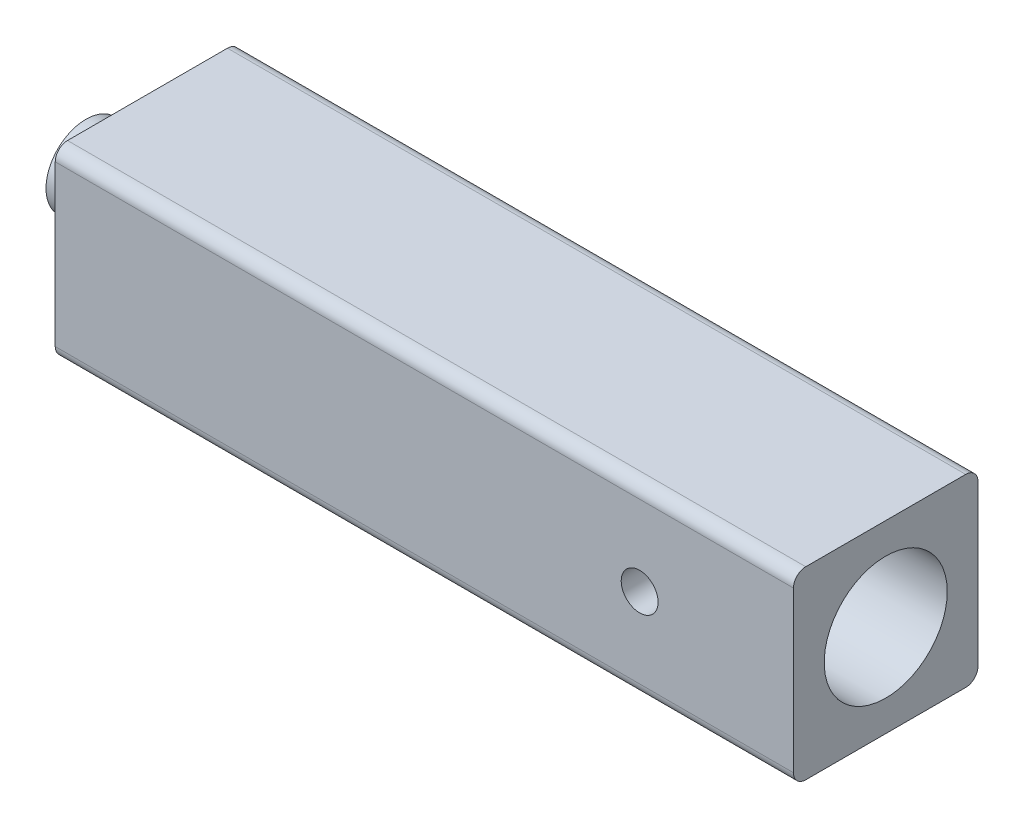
ISO-10303-21;
HEADER;
FILE_DESCRIPTION(('STEP AP214'),'2;1');
FILE_NAME('part.step','',(''),(''),'','','');
FILE_SCHEMA(('AUTOMOTIVE_DESIGN { 1 0 10303 214 1 1 1 1 }'));
ENDSEC;
DATA;
#1=APPLICATION_CONTEXT('core data for automotive mechanical design processes');
#2=APPLICATION_PROTOCOL_DEFINITION('international standard','automotive_design',2000,#1);
#3=PRODUCT_CONTEXT('',#1,'mechanical');
#4=PRODUCT('Part','Part','',(#3));
#5=PRODUCT_RELATED_PRODUCT_CATEGORY('part','',(#4));
#6=PRODUCT_DEFINITION_FORMATION('','',#4);
#7=PRODUCT_DEFINITION_CONTEXT('part definition',#1,'design');
#8=PRODUCT_DEFINITION('design','',#6,#7);
#9=PRODUCT_DEFINITION_SHAPE('','',#8);
#10=(LENGTH_UNIT() NAMED_UNIT(*) SI_UNIT(.MILLI.,.METRE.));
#11=(NAMED_UNIT(*) PLANE_ANGLE_UNIT() SI_UNIT($,.RADIAN.));
#12=(NAMED_UNIT(*) SI_UNIT($,.STERADIAN.) SOLID_ANGLE_UNIT());
#13=UNCERTAINTY_MEASURE_WITH_UNIT(LENGTH_MEASURE(1.E-05),#10,'distance_accuracy_value','');
#14=(GEOMETRIC_REPRESENTATION_CONTEXT(3) GLOBAL_UNCERTAINTY_ASSIGNED_CONTEXT((#13)) GLOBAL_UNIT_ASSIGNED_CONTEXT((#10,
#11,#12)) REPRESENTATION_CONTEXT('',''));
#15=CARTESIAN_POINT('',(0.,0.,0.));
#16=DIRECTION('',(0.,0.,1.));
#17=DIRECTION('',(1.,0.,0.));
#18=AXIS2_PLACEMENT_3D('',#15,#16,#17);
#19=CARTESIAN_POINT('',(120.,-15.,15.));
#20=DIRECTION('',(0.,0.,-1.));
#21=DIRECTION('',(-1.,0.,0.));
#22=AXIS2_PLACEMENT_3D('',#19,#20,#21);
#23=PLANE('',#22);
#24=CARTESIAN_POINT('',(95.,0.,15.));
#25=DIRECTION('',(0.,0.,-1.));
#26=DIRECTION('',(-1.,0.,0.));
#27=AXIS2_PLACEMENT_3D('',#24,#25,#26);
#28=CIRCLE('',#27,3.00000000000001);
#29=CARTESIAN_POINT('',(92.,0.,15.));
#30=VERTEX_POINT('',#29);
#31=EDGE_CURVE('E256',#30,#30,#28,.T.);
#32=ORIENTED_EDGE('',*,*,#31,.T.);
#33=EDGE_LOOP('',(#32));
#34=FACE_BOUND('',#33,.T.);
#35=DIRECTION('',(0.,-1.,0.));
#36=VECTOR('',#35,1.);
#37=CARTESIAN_POINT('',(0.,-15.,15.));
#38=LINE('',#37,#36);
#39=CARTESIAN_POINT('',(0.,13.,15.));
#40=VERTEX_POINT('',#39);
#41=CARTESIAN_POINT('',(0.,-13.,15.));
#42=VERTEX_POINT('',#41);
#43=EDGE_CURVE('E125',#40,#42,#38,.T.);
#44=ORIENTED_EDGE('',*,*,#43,.T.);
#45=DIRECTION('',(-1.,0.,0.));
#46=VECTOR('',#45,1.);
#47=CARTESIAN_POINT('',(120.,-13.,15.));
#48=LINE('',#47,#46);
#49=CARTESIAN_POINT('',(120.,-13.,15.));
#50=VERTEX_POINT('',#49);
#51=EDGE_CURVE('E103',#42,#50,#48,.F.);
#52=ORIENTED_EDGE('',*,*,#51,.T.);
#53=DIRECTION('',(0.,-1.,0.));
#54=VECTOR('',#53,1.);
#55=CARTESIAN_POINT('',(120.,-15.,15.));
#56=LINE('',#55,#54);
#57=CARTESIAN_POINT('',(120.,13.,15.));
#58=VERTEX_POINT('',#57);
#59=EDGE_CURVE('E135',#58,#50,#56,.T.);
#60=ORIENTED_EDGE('',*,*,#59,.F.);
#61=DIRECTION('',(-1.,0.,0.));
#62=VECTOR('',#61,1.);
#63=CARTESIAN_POINT('',(120.,13.,15.));
#64=LINE('',#63,#62);
#65=EDGE_CURVE('E108',#58,#40,#64,.T.);
#66=ORIENTED_EDGE('',*,*,#65,.T.);
#67=EDGE_LOOP('',(#44,#52,#60,#66));
#68=FACE_BOUND('',#67,.T.);
#69=ADVANCED_FACE('F32',(#34,#68),#23,.F.);
#70=CARTESIAN_POINT('',(120.,-15.,-15.));
#71=DIRECTION('',(0.,1.,0.));
#72=DIRECTION('',(0.,0.,1.));
#73=AXIS2_PLACEMENT_3D('',#70,#71,#72);
#74=PLANE('',#73);
#75=DIRECTION('',(0.,0.,-1.));
#76=VECTOR('',#75,1.);
#77=CARTESIAN_POINT('',(120.,-15.,-15.));
#78=LINE('',#77,#76);
#79=CARTESIAN_POINT('',(120.,-15.,13.));
#80=VERTEX_POINT('',#79);
#81=CARTESIAN_POINT('',(120.,-15.,-13.));
#82=VERTEX_POINT('',#81);
#83=EDGE_CURVE('E118',#80,#82,#78,.T.);
#84=ORIENTED_EDGE('',*,*,#83,.F.);
#85=DIRECTION('',(-1.,0.,0.));
#86=VECTOR('',#85,1.);
#87=CARTESIAN_POINT('',(120.,-15.,13.));
#88=LINE('',#87,#86);
#89=CARTESIAN_POINT('',(0.,-15.,13.));
#90=VERTEX_POINT('',#89);
#91=EDGE_CURVE('E102',#80,#90,#88,.T.);
#92=ORIENTED_EDGE('',*,*,#91,.T.);
#93=DIRECTION('',(0.,0.,-1.));
#94=VECTOR('',#93,1.);
#95=CARTESIAN_POINT('',(0.,-15.,-15.));
#96=LINE('',#95,#94);
#97=CARTESIAN_POINT('',(0.,-15.,-13.));
#98=VERTEX_POINT('',#97);
#99=EDGE_CURVE('E115',#90,#98,#96,.T.);
#100=ORIENTED_EDGE('',*,*,#99,.T.);
#101=DIRECTION('',(-1.,0.,0.));
#102=VECTOR('',#101,1.);
#103=CARTESIAN_POINT('',(120.,-15.,-13.));
#104=LINE('',#103,#102);
#105=EDGE_CURVE('E120',#98,#82,#104,.F.);
#106=ORIENTED_EDGE('',*,*,#105,.T.);
#107=EDGE_LOOP('',(#84,#92,#100,#106));
#108=FACE_BOUND('',#107,.T.);
#109=ADVANCED_FACE('F114',(#108),#74,.F.);
#110=CARTESIAN_POINT('',(120.,-15.,-15.));
#111=DIRECTION('',(0.,0.,1.));
#112=DIRECTION('',(1.,0.,0.));
#113=AXIS2_PLACEMENT_3D('',#110,#111,#112);
#114=PLANE('',#113);
#115=CARTESIAN_POINT('',(95.,0.,-15.));
#116=DIRECTION('',(0.,0.,1.));
#117=DIRECTION('',(1.,0.,0.));
#118=AXIS2_PLACEMENT_3D('',#115,#116,#117);
#119=CIRCLE('',#118,3.00000000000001);
#120=CARTESIAN_POINT('',(98.,0.,-15.));
#121=VERTEX_POINT('',#120);
#122=EDGE_CURVE('E254',#121,#121,#119,.T.);
#123=ORIENTED_EDGE('',*,*,#122,.T.);
#124=EDGE_LOOP('',(#123));
#125=FACE_BOUND('',#124,.T.);
#126=DIRECTION('',(0.,1.,0.));
#127=VECTOR('',#126,1.);
#128=CARTESIAN_POINT('',(120.,-15.,-15.));
#129=LINE('',#128,#127);
#130=CARTESIAN_POINT('',(120.,-13.,-15.));
#131=VERTEX_POINT('',#130);
#132=CARTESIAN_POINT('',(120.,13.,-15.));
#133=VERTEX_POINT('',#132);
#134=EDGE_CURVE('E212',#131,#133,#129,.T.);
#135=ORIENTED_EDGE('',*,*,#134,.F.);
#136=DIRECTION('',(-1.,0.,0.));
#137=VECTOR('',#136,1.);
#138=CARTESIAN_POINT('',(120.,-13.,-15.));
#139=LINE('',#138,#137);
#140=CARTESIAN_POINT('',(0.,-13.,-15.));
#141=VERTEX_POINT('',#140);
#142=EDGE_CURVE('E207',#131,#141,#139,.T.);
#143=ORIENTED_EDGE('',*,*,#142,.T.);
#144=DIRECTION('',(0.,1.,0.));
#145=VECTOR('',#144,1.);
#146=CARTESIAN_POINT('',(0.,-15.,-15.));
#147=LINE('',#146,#145);
#148=CARTESIAN_POINT('',(0.,13.,-15.));
#149=VERTEX_POINT('',#148);
#150=EDGE_CURVE('E124',#141,#149,#147,.T.);
#151=ORIENTED_EDGE('',*,*,#150,.T.);
#152=DIRECTION('',(-1.,0.,0.));
#153=VECTOR('',#152,1.);
#154=CARTESIAN_POINT('',(120.,13.,-15.));
#155=LINE('',#154,#153);
#156=EDGE_CURVE('E196',#149,#133,#155,.F.);
#157=ORIENTED_EDGE('',*,*,#156,.T.);
#158=EDGE_LOOP('',(#135,#143,#151,#157));
#159=FACE_BOUND('',#158,.T.);
#160=ADVANCED_FACE('F175',(#125,#159),#114,.F.);
#161=CARTESIAN_POINT('',(120.,15.,-15.));
#162=DIRECTION('',(0.,-1.,0.));
#163=DIRECTION('',(0.,0.,-1.));
#164=AXIS2_PLACEMENT_3D('',#161,#162,#163);
#165=PLANE('',#164);
#166=DIRECTION('',(0.,0.,1.));
#167=VECTOR('',#166,1.);
#168=CARTESIAN_POINT('',(120.,15.,-15.));
#169=LINE('',#168,#167);
#170=CARTESIAN_POINT('',(120.,15.,-13.));
#171=VERTEX_POINT('',#170);
#172=CARTESIAN_POINT('',(120.,15.,13.));
#173=VERTEX_POINT('',#172);
#174=EDGE_CURVE('E232',#171,#173,#169,.T.);
#175=ORIENTED_EDGE('',*,*,#174,.F.);
#176=DIRECTION('',(-1.,0.,0.));
#177=VECTOR('',#176,1.);
#178=CARTESIAN_POINT('',(120.,15.,-13.));
#179=LINE('',#178,#177);
#180=CARTESIAN_POINT('',(0.,15.,-13.));
#181=VERTEX_POINT('',#180);
#182=EDGE_CURVE('E11',#171,#181,#179,.T.);
#183=ORIENTED_EDGE('',*,*,#182,.T.);
#184=DIRECTION('',(0.,0.,1.));
#185=VECTOR('',#184,1.);
#186=CARTESIAN_POINT('',(0.,15.,-15.));
#187=LINE('',#186,#185);
#188=CARTESIAN_POINT('',(0.,15.,13.));
#189=VERTEX_POINT('',#188);
#190=EDGE_CURVE('E128',#181,#189,#187,.T.);
#191=ORIENTED_EDGE('',*,*,#190,.T.);
#192=DIRECTION('',(-1.,0.,0.));
#193=VECTOR('',#192,1.);
#194=CARTESIAN_POINT('',(120.,15.,13.));
#195=LINE('',#194,#193);
#196=EDGE_CURVE('E40',#189,#173,#195,.F.);
#197=ORIENTED_EDGE('',*,*,#196,.T.);
#198=EDGE_LOOP('',(#175,#183,#191,#197));
#199=FACE_BOUND('',#198,.T.);
#200=ADVANCED_FACE('F244',(#199),#165,.F.);
#201=CARTESIAN_POINT('',(120.,0.,0.));
#202=DIRECTION('',(1.,0.,0.));
#203=DIRECTION('',(0.,0.,-1.));
#204=AXIS2_PLACEMENT_3D('',#201,#202,#203);
#205=PLANE('',#204);
#206=CARTESIAN_POINT('',(120.,0.,0.));
#207=DIRECTION('',(1.,0.,0.));
#208=DIRECTION('',(0.,0.,-1.));
#209=AXIS2_PLACEMENT_3D('',#206,#207,#208);
#210=CIRCLE('',#209,10.);
#211=CARTESIAN_POINT('',(120.,0.,-10.));
#212=VERTEX_POINT('',#211);
#213=EDGE_CURVE('E229',#212,#212,#210,.T.);
#214=ORIENTED_EDGE('',*,*,#213,.F.);
#215=EDGE_LOOP('',(#214));
#216=FACE_BOUND('',#215,.T.);
#217=ORIENTED_EDGE('',*,*,#59,.T.);
#218=CARTESIAN_POINT('',(120.,-13.,13.));
#219=DIRECTION('',(1.,0.,0.));
#220=DIRECTION('',(0.,0.,-1.));
#221=AXIS2_PLACEMENT_3D('',#218,#219,#220);
#222=CIRCLE('',#221,2.);
#223=EDGE_CURVE('E200',#50,#80,#222,.T.);
#224=ORIENTED_EDGE('',*,*,#223,.T.);
#225=ORIENTED_EDGE('',*,*,#83,.T.);
#226=CARTESIAN_POINT('',(120.,-13.,-13.));
#227=DIRECTION('',(1.,0.,0.));
#228=DIRECTION('',(0.,0.,-1.));
#229=AXIS2_PLACEMENT_3D('',#226,#227,#228);
#230=CIRCLE('',#229,2.);
#231=EDGE_CURVE('E197',#82,#131,#230,.T.);
#232=ORIENTED_EDGE('',*,*,#231,.T.);
#233=ORIENTED_EDGE('',*,*,#134,.T.);
#234=CARTESIAN_POINT('',(120.,13.,-13.));
#235=DIRECTION('',(1.,0.,0.));
#236=DIRECTION('',(0.,0.,-1.));
#237=AXIS2_PLACEMENT_3D('',#234,#235,#236);
#238=CIRCLE('',#237,2.);
#239=EDGE_CURVE('E53',#133,#171,#238,.T.);
#240=ORIENTED_EDGE('',*,*,#239,.T.);
#241=ORIENTED_EDGE('',*,*,#174,.T.);
#242=CARTESIAN_POINT('',(120.,13.,13.));
#243=DIRECTION('',(1.,0.,0.));
#244=DIRECTION('',(0.,0.,-1.));
#245=AXIS2_PLACEMENT_3D('',#242,#243,#244);
#246=CIRCLE('',#245,2.);
#247=EDGE_CURVE('E198',#173,#58,#246,.T.);
#248=ORIENTED_EDGE('',*,*,#247,.T.);
#249=EDGE_LOOP('',(#217,#224,#225,#232,#233,#240,#241,#248));
#250=FACE_BOUND('',#249,.T.);
#251=ADVANCED_FACE('F224',(#216,#250),#205,.T.);
#252=CARTESIAN_POINT('',(0.,0.,0.));
#253=DIRECTION('',(1.,0.,0.));
#254=DIRECTION('',(0.,0.,-1.));
#255=AXIS2_PLACEMENT_3D('',#252,#253,#254);
#256=PLANE('',#255);
#257=CARTESIAN_POINT('',(0.,0.,0.));
#258=DIRECTION('',(1.,0.,0.));
#259=DIRECTION('',(0.,0.,-1.));
#260=AXIS2_PLACEMENT_3D('',#257,#258,#259);
#261=CIRCLE('',#260,6.5);
#262=CARTESIAN_POINT('',(0.,0.,-6.5));
#263=VERTEX_POINT('',#262);
#264=EDGE_CURVE('E233',#263,#263,#261,.F.);
#265=ORIENTED_EDGE('',*,*,#264,.F.);
#266=EDGE_LOOP('',(#265));
#267=FACE_BOUND('',#266,.T.);
#268=ORIENTED_EDGE('',*,*,#99,.F.);
#269=CARTESIAN_POINT('',(0.,-13.,13.));
#270=DIRECTION('',(1.,0.,0.));
#271=DIRECTION('',(0.,0.,-1.));
#272=AXIS2_PLACEMENT_3D('',#269,#270,#271);
#273=CIRCLE('',#272,2.);
#274=EDGE_CURVE('E98',#90,#42,#273,.F.);
#275=ORIENTED_EDGE('',*,*,#274,.T.);
#276=ORIENTED_EDGE('',*,*,#43,.F.);
#277=CARTESIAN_POINT('',(0.,13.,13.));
#278=DIRECTION('',(1.,0.,0.));
#279=DIRECTION('',(0.,0.,-1.));
#280=AXIS2_PLACEMENT_3D('',#277,#278,#279);
#281=CIRCLE('',#280,2.);
#282=EDGE_CURVE('E119',#40,#189,#281,.F.);
#283=ORIENTED_EDGE('',*,*,#282,.T.);
#284=ORIENTED_EDGE('',*,*,#190,.F.);
#285=CARTESIAN_POINT('',(0.,13.,-13.));
#286=DIRECTION('',(1.,0.,0.));
#287=DIRECTION('',(0.,0.,-1.));
#288=AXIS2_PLACEMENT_3D('',#285,#286,#287);
#289=CIRCLE('',#288,2.);
#290=EDGE_CURVE('E215',#181,#149,#289,.F.);
#291=ORIENTED_EDGE('',*,*,#290,.T.);
#292=ORIENTED_EDGE('',*,*,#150,.F.);
#293=CARTESIAN_POINT('',(0.,-13.,-13.));
#294=DIRECTION('',(1.,0.,0.));
#295=DIRECTION('',(0.,0.,-1.));
#296=AXIS2_PLACEMENT_3D('',#293,#294,#295);
#297=CIRCLE('',#296,2.);
#298=EDGE_CURVE('E109',#141,#98,#297,.F.);
#299=ORIENTED_EDGE('',*,*,#298,.T.);
#300=EDGE_LOOP('',(#268,#275,#276,#283,#284,#291,#292,#299));
#301=FACE_BOUND('',#300,.T.);
#302=ADVANCED_FACE('F122',(#267,#301),#256,.F.);
#303=CARTESIAN_POINT('',(80.,0.,0.));
#304=DIRECTION('',(1.,0.,0.));
#305=DIRECTION('',(0.,0.,-1.));
#306=AXIS2_PLACEMENT_3D('',#303,#304,#305);
#307=CYLINDRICAL_SURFACE('',#306,10.);
#308=CARTESIAN_POINT('',(92.,0.,-10.));
#309=CARTESIAN_POINT('',(92.0000019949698,0.164577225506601,-9.999998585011));
#310=CARTESIAN_POINT('',(92.0135877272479,0.329174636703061,-9.99589831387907));
#311=CARTESIAN_POINT('',(92.0674427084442,0.653576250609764,-9.97994211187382));
#312=CARTESIAN_POINT('',(92.1077199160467,0.813379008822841,-9.96808386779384));
#313=CARTESIAN_POINT('',(92.2134920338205,1.12346541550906,-9.93791105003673));
#314=CARTESIAN_POINT('',(92.2789497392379,1.27376272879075,-9.91960600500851));
#315=CARTESIAN_POINT('',(92.4330721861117,1.56124836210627,-9.8784421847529));
#316=CARTESIAN_POINT('',(92.5217400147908,1.69843493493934,-9.85558280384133));
#317=CARTESIAN_POINT('',(92.7224480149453,1.95974359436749,-9.80701474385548));
#318=CARTESIAN_POINT('',(92.8350332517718,2.08343614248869,-9.78124767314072));
#319=CARTESIAN_POINT('',(93.0792184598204,2.31049841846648,-9.73011668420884));
#320=CARTESIAN_POINT('',(93.2108216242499,2.41386472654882,-9.70475283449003));
#321=CARTESIAN_POINT('',(93.4929415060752,2.59960075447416,-9.65668227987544));
#322=CARTESIAN_POINT('',(93.6438169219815,2.68144618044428,-9.63404813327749));
#323=CARTESIAN_POINT('',(93.9579785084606,2.81842789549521,-9.59487240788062));
#324=CARTESIAN_POINT('',(94.1212616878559,2.87357059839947,-9.57832936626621));
#325=CARTESIAN_POINT('',(94.4507805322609,2.95403267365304,-9.55381741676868));
#326=CARTESIAN_POINT('',(94.6168054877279,2.98014392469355,-9.54562138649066));
#327=CARTESIAN_POINT('',(94.9510663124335,3.00427461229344,-9.53805579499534));
#328=CARTESIAN_POINT('',(95.1193016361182,3.00230085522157,-9.53868409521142));
#329=CARTESIAN_POINT('',(95.446767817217,2.97093954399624,-9.54849488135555));
#330=CARTESIAN_POINT('',(95.6061045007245,2.94254410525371,-9.55736777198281));
#331=CARTESIAN_POINT('',(95.9176395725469,2.86074840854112,-9.58216712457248));
#332=CARTESIAN_POINT('',(96.0698372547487,2.80734568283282,-9.59809428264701));
#333=CARTESIAN_POINT('',(96.3652006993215,2.67632053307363,-9.63545466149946));
#334=CARTESIAN_POINT('',(96.5082141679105,2.59837633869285,-9.65696032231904));
#335=CARTESIAN_POINT('',(96.7794640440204,2.42070445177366,-9.70301974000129));
#336=CARTESIAN_POINT('',(96.9076968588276,2.32097148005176,-9.72757423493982));
#337=CARTESIAN_POINT('',(97.1513723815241,2.09762581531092,-9.77822022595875));
#338=CARTESIAN_POINT('',(97.2660573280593,1.97318981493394,-9.80433308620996));
#339=CARTESIAN_POINT('',(97.4731079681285,1.70652651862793,-9.85424488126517));
#340=CARTESIAN_POINT('',(97.5654722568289,1.56429810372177,-9.8780436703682));
#341=CARTESIAN_POINT('',(97.7257198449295,1.2647100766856,-9.92086320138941));
#342=CARTESIAN_POINT('',(97.7934350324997,1.10725549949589,-9.93985087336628));
#343=CARTESIAN_POINT('',(97.9011991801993,0.782490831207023,-9.97067043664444));
#344=CARTESIAN_POINT('',(97.941255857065,0.615183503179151,-9.98250432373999));
#345=CARTESIAN_POINT('',(97.9913043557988,0.281904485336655,-9.99736729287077));
#346=CARTESIAN_POINT('',(98.0023231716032,0.116100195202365,-10.0006970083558));
#347=CARTESIAN_POINT('',(97.9968616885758,-0.214999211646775,-9.99905846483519));
#348=CARTESIAN_POINT('',(97.9803850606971,-0.38029439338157,-9.99409131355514));
#349=CARTESIAN_POINT('',(97.921230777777,-0.701807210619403,-9.97661393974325));
#350=CARTESIAN_POINT('',(97.8791532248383,-0.858145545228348,-9.96427659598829));
#351=CARTESIAN_POINT('',(97.7707135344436,-1.16150927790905,-9.9334869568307));
#352=CARTESIAN_POINT('',(97.7043484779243,-1.30853355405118,-9.91503392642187));
#353=CARTESIAN_POINT('',(97.5474936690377,-1.59287437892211,-9.87339308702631));
#354=CARTESIAN_POINT('',(97.456481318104,-1.72988765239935,-9.8501056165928));
#355=CARTESIAN_POINT('',(97.2535504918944,-1.98704661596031,-9.80146937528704));
#356=CARTESIAN_POINT('',(97.1416267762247,-2.1071880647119,-9.77612008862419));
#357=CARTESIAN_POINT('',(96.8952253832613,-2.33171489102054,-9.72506343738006));
#358=CARTESIAN_POINT('',(96.7600762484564,-2.43536962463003,-9.69937650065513));
#359=CARTESIAN_POINT('',(96.4737441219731,-2.61857990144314,-9.65153030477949));
#360=CARTESIAN_POINT('',(96.3225615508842,-2.69813607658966,-9.62937095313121));
#361=CARTESIAN_POINT('',(96.00893501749,-2.83034694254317,-9.59134379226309));
#362=CARTESIAN_POINT('',(95.8465476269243,-2.88312693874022,-9.575446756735));
#363=CARTESIAN_POINT('',(95.5146240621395,-2.96043461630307,-9.55183188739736));
#364=CARTESIAN_POINT('',(95.3450903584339,-2.9849719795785,-9.54411125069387));
#365=CARTESIAN_POINT('',(95.0112769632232,-3.00443968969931,-9.53799944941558));
#366=CARTESIAN_POINT('',(94.8470726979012,-3.00056110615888,-9.53923294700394));
#367=CARTESIAN_POINT('',(94.5217717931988,-2.96615010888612,-9.54998802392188));
#368=CARTESIAN_POINT('',(94.360675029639,-2.93561876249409,-9.55950927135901));
#369=CARTESIAN_POINT('',(94.0481092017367,-2.84953777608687,-9.58551527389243));
#370=CARTESIAN_POINT('',(93.8965454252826,-2.79430351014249,-9.60191209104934));
#371=CARTESIAN_POINT('',(93.6047151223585,-2.66063014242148,-9.63980557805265));
#372=CARTESIAN_POINT('',(93.4644507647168,-2.58218659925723,-9.6613032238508));
#373=CARTESIAN_POINT('',(93.1936737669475,-2.40097527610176,-9.70795352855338));
#374=CARTESIAN_POINT('',(93.0637024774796,-2.29742552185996,-9.7332108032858));
#375=CARTESIAN_POINT('',(92.8225950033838,-2.07034869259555,-9.78402640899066));
#376=CARTESIAN_POINT('',(92.7114637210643,-1.94681643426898,-9.80958481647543));
#377=CARTESIAN_POINT('',(92.5079531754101,-1.67893152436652,-9.85901873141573));
#378=CARTESIAN_POINT('',(92.416217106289,-1.53407577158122,-9.88282319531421));
#379=CARTESIAN_POINT('',(92.2585296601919,-1.23028274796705,-9.92521360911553));
#380=CARTESIAN_POINT('',(92.192566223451,-1.07135210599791,-9.94380199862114));
#381=CARTESIAN_POINT('',(92.0942094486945,-0.76151542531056,-9.97204349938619));
#382=CARTESIAN_POINT('',(92.0589766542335,-0.611573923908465,-9.9824405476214));
#383=CARTESIAN_POINT('',(92.0118729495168,-0.307760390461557,-9.9964188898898));
#384=CARTESIAN_POINT('',(91.9999981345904,-0.153889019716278,-10.0000013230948));
#385=CARTESIAN_POINT('',(92.,0.,-10.));
#386=B_SPLINE_CURVE_WITH_KNOTS('',3,(#308,#309,#310,#311,#312,#313,#314,#315,#316,#317,#318,
#319,#320,#321,#322,#323,#324,#325,#326,#327,#328,#329,#330,#331,#332,#333,#334,#335,#336,#337,
#338,#339,#340,#341,#342,#343,#344,#345,#346,#347,#348,#349,#350,#351,#352,#353,#354,#355,#356,
#357,#358,#359,#360,#361,#362,#363,#364,#365,#366,#367,#368,#369,#370,#371,#372,#373,#374,#375,
#376,#377,#378,#379,#380,#381,#382,#383,#384,#385),.UNSPECIFIED.,.T.,.F.,(4,2,2,2,2,2,2,2,2,2,2,
2,2,2,2,2,2,2,2,2,2,2,2,2,2,2,2,2,2,2,2,2,2,2,2,2,2,2,4),(0.,0.493166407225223,
0.986479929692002,1.47906735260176,1.97172032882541,2.47711205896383,2.98258874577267,
3.4994296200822,4.01614629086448,4.51839378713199,5.02051956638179,5.50452033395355,
5.98856887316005,6.47924852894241,6.97004720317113,7.48134208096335,7.99266913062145,
8.50742093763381,9.02202907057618,9.51817618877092,10.0142570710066,10.4991349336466,
10.9840710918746,11.4802261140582,11.9765056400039,12.4908080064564,13.0050968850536,
13.5169562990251,14.0286401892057,14.5190031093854,15.0093463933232,15.4936008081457,
15.9779479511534,16.4799385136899,16.9820594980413,17.4988599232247,18.015418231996,
18.4766338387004,18.9377723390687),.UNSPECIFIED.);
#387=CARTESIAN_POINT('',(92.,0.,-10.));
#388=VERTEX_POINT('',#387);
#389=EDGE_CURVE('E143',#388,#388,#386,.T.);
#390=ORIENTED_EDGE('',*,*,#389,.T.);
#391=EDGE_LOOP('',(#390));
#392=FACE_BOUND('',#391,.T.);
#393=CARTESIAN_POINT('',(98.,0.,10.));
#394=CARTESIAN_POINT('',(97.9999980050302,0.164577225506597,9.99999858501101));
#395=CARTESIAN_POINT('',(97.9864122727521,0.329174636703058,9.99589831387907));
#396=CARTESIAN_POINT('',(97.9325572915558,0.653576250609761,9.97994211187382));
#397=CARTESIAN_POINT('',(97.8922800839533,0.813379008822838,9.96808386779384));
#398=CARTESIAN_POINT('',(97.7865079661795,1.12346541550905,9.93791105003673));
#399=CARTESIAN_POINT('',(97.7210502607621,1.27376272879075,9.91960600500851));
#400=CARTESIAN_POINT('',(97.5669278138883,1.56124836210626,9.87844218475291));
#401=CARTESIAN_POINT('',(97.4782599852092,1.69843493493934,9.85558280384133));
#402=CARTESIAN_POINT('',(97.2775519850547,1.95974359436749,9.80701474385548));
#403=CARTESIAN_POINT('',(97.1649667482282,2.08343614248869,9.78124767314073));
#404=CARTESIAN_POINT('',(96.9207815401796,2.31049841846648,9.73011668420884));
#405=CARTESIAN_POINT('',(96.7891783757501,2.41386472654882,9.70475283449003));
#406=CARTESIAN_POINT('',(96.5070584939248,2.59960075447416,9.65668227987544));
#407=CARTESIAN_POINT('',(96.3561830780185,2.68144618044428,9.63404813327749));
#408=CARTESIAN_POINT('',(96.0420214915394,2.81842789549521,9.59487240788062));
#409=CARTESIAN_POINT('',(95.8787383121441,2.87357059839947,9.57832936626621));
#410=CARTESIAN_POINT('',(95.5492194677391,2.95403267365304,9.55381741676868));
#411=CARTESIAN_POINT('',(95.3831945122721,2.98014392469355,9.54562138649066));
#412=CARTESIAN_POINT('',(95.0489336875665,3.00427461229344,9.53805579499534));
#413=CARTESIAN_POINT('',(94.8806983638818,3.00230085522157,9.53868409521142));
#414=CARTESIAN_POINT('',(94.553232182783,2.97093954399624,9.54849488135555));
#415=CARTESIAN_POINT('',(94.3938954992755,2.94254410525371,9.55736777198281));
#416=CARTESIAN_POINT('',(94.0823604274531,2.86074840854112,9.58216712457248));
#417=CARTESIAN_POINT('',(93.9301627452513,2.80734568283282,9.59809428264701));
#418=CARTESIAN_POINT('',(93.6347993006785,2.67632053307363,9.63545466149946));
#419=CARTESIAN_POINT('',(93.4917858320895,2.59837633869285,9.65696032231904));
#420=CARTESIAN_POINT('',(93.2205359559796,2.42070445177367,9.70301974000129));
#421=CARTESIAN_POINT('',(93.0923031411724,2.32097148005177,9.72757423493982));
#422=CARTESIAN_POINT('',(92.848627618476,2.09762581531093,9.77822022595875));
#423=CARTESIAN_POINT('',(92.7339426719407,1.97318981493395,9.80433308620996));
#424=CARTESIAN_POINT('',(92.5268920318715,1.70652651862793,9.85424488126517));
#425=CARTESIAN_POINT('',(92.4345277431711,1.56429810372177,9.8780436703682));
#426=CARTESIAN_POINT('',(92.2742801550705,1.2647100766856,9.92086320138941));
#427=CARTESIAN_POINT('',(92.2065649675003,1.1072554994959,9.93985087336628));
#428=CARTESIAN_POINT('',(92.0988008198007,0.782490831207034,9.97067043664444));
#429=CARTESIAN_POINT('',(92.058744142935,0.615183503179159,9.98250432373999));
#430=CARTESIAN_POINT('',(92.0086956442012,0.281904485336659,9.99736729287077));
#431=CARTESIAN_POINT('',(91.9976768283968,0.11610019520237,10.0006970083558));
#432=CARTESIAN_POINT('',(92.0031383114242,-0.21499921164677,9.99905846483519));
#433=CARTESIAN_POINT('',(92.0196149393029,-0.380294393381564,9.99409131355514));
#434=CARTESIAN_POINT('',(92.078769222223,-0.701807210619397,9.97661393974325));
#435=CARTESIAN_POINT('',(92.1208467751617,-0.858145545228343,9.96427659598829));
#436=CARTESIAN_POINT('',(92.2292864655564,-1.16150927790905,9.9334869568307));
#437=CARTESIAN_POINT('',(92.2956515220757,-1.30853355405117,9.91503392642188));
#438=CARTESIAN_POINT('',(92.4525063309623,-1.59287437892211,9.87339308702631));
#439=CARTESIAN_POINT('',(92.543518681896,-1.72988765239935,9.8501056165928));
#440=CARTESIAN_POINT('',(92.7464495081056,-1.98704661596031,9.80146937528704));
#441=CARTESIAN_POINT('',(92.8583732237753,-2.10718806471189,9.77612008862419));
#442=CARTESIAN_POINT('',(93.1047746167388,-2.33171489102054,9.72506343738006));
#443=CARTESIAN_POINT('',(93.2399237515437,-2.43536962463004,9.69937650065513));
#444=CARTESIAN_POINT('',(93.5262558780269,-2.61857990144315,9.65153030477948));
#445=CARTESIAN_POINT('',(93.6774384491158,-2.69813607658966,9.62937095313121));
#446=CARTESIAN_POINT('',(93.99106498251,-2.83034694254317,9.59134379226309));
#447=CARTESIAN_POINT('',(94.1534523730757,-2.88312693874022,9.575446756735));
#448=CARTESIAN_POINT('',(94.4853759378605,-2.96043461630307,9.55183188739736));
#449=CARTESIAN_POINT('',(94.6549096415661,-2.9849719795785,9.54411125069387));
#450=CARTESIAN_POINT('',(94.9887230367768,-3.00443968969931,9.53799944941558));
#451=CARTESIAN_POINT('',(95.1529273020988,-3.00056110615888,9.53923294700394));
#452=CARTESIAN_POINT('',(95.4782282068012,-2.96615010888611,9.54998802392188));
#453=CARTESIAN_POINT('',(95.639324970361,-2.93561876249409,9.55950927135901));
#454=CARTESIAN_POINT('',(95.9518907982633,-2.84953777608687,9.58551527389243));
#455=CARTESIAN_POINT('',(96.1034545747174,-2.79430351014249,9.60191209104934));
#456=CARTESIAN_POINT('',(96.3952848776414,-2.66063014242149,9.63980557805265));
#457=CARTESIAN_POINT('',(96.5355492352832,-2.58218659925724,9.6613032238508));
#458=CARTESIAN_POINT('',(96.8063262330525,-2.40097527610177,9.70795352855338));
#459=CARTESIAN_POINT('',(96.9362975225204,-2.29742552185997,9.7332108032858));
#460=CARTESIAN_POINT('',(97.1774049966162,-2.07034869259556,9.78402640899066));
#461=CARTESIAN_POINT('',(97.2885362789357,-1.94681643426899,9.80958481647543));
#462=CARTESIAN_POINT('',(97.4920468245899,-1.67893152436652,9.85901873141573));
#463=CARTESIAN_POINT('',(97.583782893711,-1.53407577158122,9.88282319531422));
#464=CARTESIAN_POINT('',(97.7414703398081,-1.23028274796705,9.92521360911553));
#465=CARTESIAN_POINT('',(97.807433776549,-1.07135210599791,9.94380199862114));
#466=CARTESIAN_POINT('',(97.9057905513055,-0.761515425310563,9.97204349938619));
#467=CARTESIAN_POINT('',(97.9410233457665,-0.611573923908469,9.9824405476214));
#468=CARTESIAN_POINT('',(97.9881270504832,-0.307760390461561,9.9964188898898));
#469=CARTESIAN_POINT('',(98.0000018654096,-0.153889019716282,10.0000013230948));
#470=CARTESIAN_POINT('',(98.,0.,10.));
#471=B_SPLINE_CURVE_WITH_KNOTS('',3,(#393,#394,#395,#396,#397,#398,#399,#400,#401,#402,#403,
#404,#405,#406,#407,#408,#409,#410,#411,#412,#413,#414,#415,#416,#417,#418,#419,#420,#421,#422,
#423,#424,#425,#426,#427,#428,#429,#430,#431,#432,#433,#434,#435,#436,#437,#438,#439,#440,#441,
#442,#443,#444,#445,#446,#447,#448,#449,#450,#451,#452,#453,#454,#455,#456,#457,#458,#459,#460,
#461,#462,#463,#464,#465,#466,#467,#468,#469,#470),.UNSPECIFIED.,.T.,.F.,(4,2,2,2,2,2,2,2,2,2,2,
2,2,2,2,2,2,2,2,2,2,2,2,2,2,2,2,2,2,2,2,2,2,2,2,2,2,2,4),(0.,0.493166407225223,
0.986479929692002,1.47906735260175,1.97172032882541,2.47711205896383,2.98258874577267,
3.4994296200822,4.01614629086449,4.51839378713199,5.02051956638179,5.50452033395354,
5.98856887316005,6.47924852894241,6.97004720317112,7.48134208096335,7.99266913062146,
8.5074209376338,9.02202907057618,9.51817618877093,10.0142570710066,10.4991349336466,
10.9840710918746,11.4802261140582,11.9765056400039,12.4908080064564,13.0050968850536,
13.5169562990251,14.0286401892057,14.5190031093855,15.0093463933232,15.4936008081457,
15.9779479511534,16.4799385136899,16.9820594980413,17.4988599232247,18.015418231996,
18.4766338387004,18.9377723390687),.UNSPECIFIED.);
#472=CARTESIAN_POINT('',(98.,0.,10.));
#473=VERTEX_POINT('',#472);
#474=EDGE_CURVE('E136',#473,#473,#471,.T.);
#475=ORIENTED_EDGE('',*,*,#474,.T.);
#476=EDGE_LOOP('',(#475));
#477=FACE_BOUND('',#476,.T.);
#478=CARTESIAN_POINT('',(80.,0.,0.));
#479=DIRECTION('',(1.,0.,0.));
#480=DIRECTION('',(0.,0.,-1.));
#481=AXIS2_PLACEMENT_3D('',#478,#479,#480);
#482=CIRCLE('',#481,10.);
#483=CARTESIAN_POINT('',(80.,0.,-10.));
#484=VERTEX_POINT('',#483);
#485=EDGE_CURVE('E130',#484,#484,#482,.T.);
#486=ORIENTED_EDGE('',*,*,#485,.F.);
#487=EDGE_LOOP('',(#486));
#488=FACE_BOUND('',#487,.T.);
#489=ORIENTED_EDGE('',*,*,#213,.T.);
#490=EDGE_LOOP('',(#489));
#491=FACE_BOUND('',#490,.T.);
#492=ADVANCED_FACE('F148',(#392,#477,#488,#491),#307,.F.);
#493=CARTESIAN_POINT('',(80.,0.,0.));
#494=DIRECTION('',(1.,0.,0.));
#495=DIRECTION('',(0.,0.,-1.));
#496=AXIS2_PLACEMENT_3D('',#493,#494,#495);
#497=PLANE('',#496);
#498=ORIENTED_EDGE('',*,*,#485,.T.);
#499=EDGE_LOOP('',(#498));
#500=FACE_BOUND('',#499,.T.);
#501=ADVANCED_FACE('F157',(#500),#497,.T.);
#502=CARTESIAN_POINT('',(95.,0.,-20.));
#503=DIRECTION('',(0.,0.,1.));
#504=DIRECTION('',(1.,0.,0.));
#505=AXIS2_PLACEMENT_3D('',#502,#503,#504);
#506=CYLINDRICAL_SURFACE('',#505,3.00000000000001);
#507=ORIENTED_EDGE('',*,*,#474,.F.);
#508=EDGE_LOOP('',(#507));
#509=FACE_BOUND('',#508,.T.);
#510=ORIENTED_EDGE('',*,*,#31,.F.);
#511=EDGE_LOOP('',(#510));
#512=FACE_BOUND('',#511,.T.);
#513=ADVANCED_FACE('F152',(#509,#512),#506,.F.);
#514=ORIENTED_EDGE('',*,*,#389,.F.);
#515=EDGE_LOOP('',(#514));
#516=FACE_BOUND('',#515,.T.);
#517=ORIENTED_EDGE('',*,*,#122,.F.);
#518=EDGE_LOOP('',(#517));
#519=FACE_BOUND('',#518,.T.);
#520=ADVANCED_FACE('F156',(#516,#519),#506,.F.);
#521=CARTESIAN_POINT('',(-10.,0.,0.));
#522=DIRECTION('',(1.,0.,0.));
#523=DIRECTION('',(0.,0.,-1.));
#524=AXIS2_PLACEMENT_3D('',#521,#522,#523);
#525=CYLINDRICAL_SURFACE('',#524,6.5);
#526=CARTESIAN_POINT('',(-10.,0.,0.));
#527=DIRECTION('',(-1.,0.,0.));
#528=DIRECTION('',(0.,0.,1.));
#529=AXIS2_PLACEMENT_3D('',#526,#527,#528);
#530=CIRCLE('',#529,6.5);
#531=CARTESIAN_POINT('',(-10.,0.,6.5));
#532=VERTEX_POINT('',#531);
#533=EDGE_CURVE('E144',#532,#532,#530,.T.);
#534=ORIENTED_EDGE('',*,*,#533,.F.);
#535=EDGE_LOOP('',(#534));
#536=FACE_BOUND('',#535,.T.);
#537=ORIENTED_EDGE('',*,*,#264,.T.);
#538=EDGE_LOOP('',(#537));
#539=FACE_BOUND('',#538,.T.);
#540=ADVANCED_FACE('F159',(#536,#539),#525,.T.);
#541=CARTESIAN_POINT('',(-10.,0.,0.));
#542=DIRECTION('',(-1.,0.,0.));
#543=DIRECTION('',(0.,0.,1.));
#544=AXIS2_PLACEMENT_3D('',#541,#542,#543);
#545=PLANE('',#544);
#546=ORIENTED_EDGE('',*,*,#533,.T.);
#547=EDGE_LOOP('',(#546));
#548=FACE_BOUND('',#547,.T.);
#549=ADVANCED_FACE('F184',(#548),#545,.T.);
#550=CARTESIAN_POINT('',(120.,-13.,13.));
#551=DIRECTION('',(-1.,0.,0.));
#552=DIRECTION('',(0.,0.,1.));
#553=AXIS2_PLACEMENT_3D('',#550,#551,#552);
#554=CYLINDRICAL_SURFACE('',#553,2.);
#555=ORIENTED_EDGE('',*,*,#223,.F.);
#556=ORIENTED_EDGE('',*,*,#51,.F.);
#557=ORIENTED_EDGE('',*,*,#274,.F.);
#558=ORIENTED_EDGE('',*,*,#91,.F.);
#559=EDGE_LOOP('',(#555,#556,#557,#558));
#560=FACE_BOUND('',#559,.T.);
#561=ADVANCED_FACE('F101',(#560),#554,.T.);
#562=CARTESIAN_POINT('',(120.,-13.,-13.));
#563=DIRECTION('',(-1.,0.,0.));
#564=DIRECTION('',(0.,0.,1.));
#565=AXIS2_PLACEMENT_3D('',#562,#563,#564);
#566=CYLINDRICAL_SURFACE('',#565,2.);
#567=ORIENTED_EDGE('',*,*,#231,.F.);
#568=ORIENTED_EDGE('',*,*,#105,.F.);
#569=ORIENTED_EDGE('',*,*,#298,.F.);
#570=ORIENTED_EDGE('',*,*,#142,.F.);
#571=EDGE_LOOP('',(#567,#568,#569,#570));
#572=FACE_BOUND('',#571,.T.);
#573=ADVANCED_FACE('F183',(#572),#566,.T.);
#574=CARTESIAN_POINT('',(120.,13.,-13.));
#575=DIRECTION('',(-1.,0.,0.));
#576=DIRECTION('',(0.,0.,1.));
#577=AXIS2_PLACEMENT_3D('',#574,#575,#576);
#578=CYLINDRICAL_SURFACE('',#577,2.);
#579=ORIENTED_EDGE('',*,*,#239,.F.);
#580=ORIENTED_EDGE('',*,*,#156,.F.);
#581=ORIENTED_EDGE('',*,*,#290,.F.);
#582=ORIENTED_EDGE('',*,*,#182,.F.);
#583=EDGE_LOOP('',(#579,#580,#581,#582));
#584=FACE_BOUND('',#583,.T.);
#585=ADVANCED_FACE('F186',(#584),#578,.T.);
#586=CARTESIAN_POINT('',(120.,13.,13.));
#587=DIRECTION('',(-1.,0.,0.));
#588=DIRECTION('',(0.,0.,1.));
#589=AXIS2_PLACEMENT_3D('',#586,#587,#588);
#590=CYLINDRICAL_SURFACE('',#589,2.);
#591=ORIENTED_EDGE('',*,*,#247,.F.);
#592=ORIENTED_EDGE('',*,*,#196,.F.);
#593=ORIENTED_EDGE('',*,*,#282,.F.);
#594=ORIENTED_EDGE('',*,*,#65,.F.);
#595=EDGE_LOOP('',(#591,#592,#593,#594));
#596=FACE_BOUND('',#595,.T.);
#597=ADVANCED_FACE('F34',(#596),#590,.T.);
#598=CLOSED_SHELL('',(#69,#109,#160,#200,#251,#302,#492,#501,#513,#520,#540,#549,#561,#573,#585,#597));
#599=MANIFOLD_SOLID_BREP('B2',#598);
#600=ADVANCED_BREP_SHAPE_REPRESENTATION('',(#18,#599),#14);
#601=SHAPE_DEFINITION_REPRESENTATION(#9,#600);
ENDSEC;
END-ISO-10303-21;
